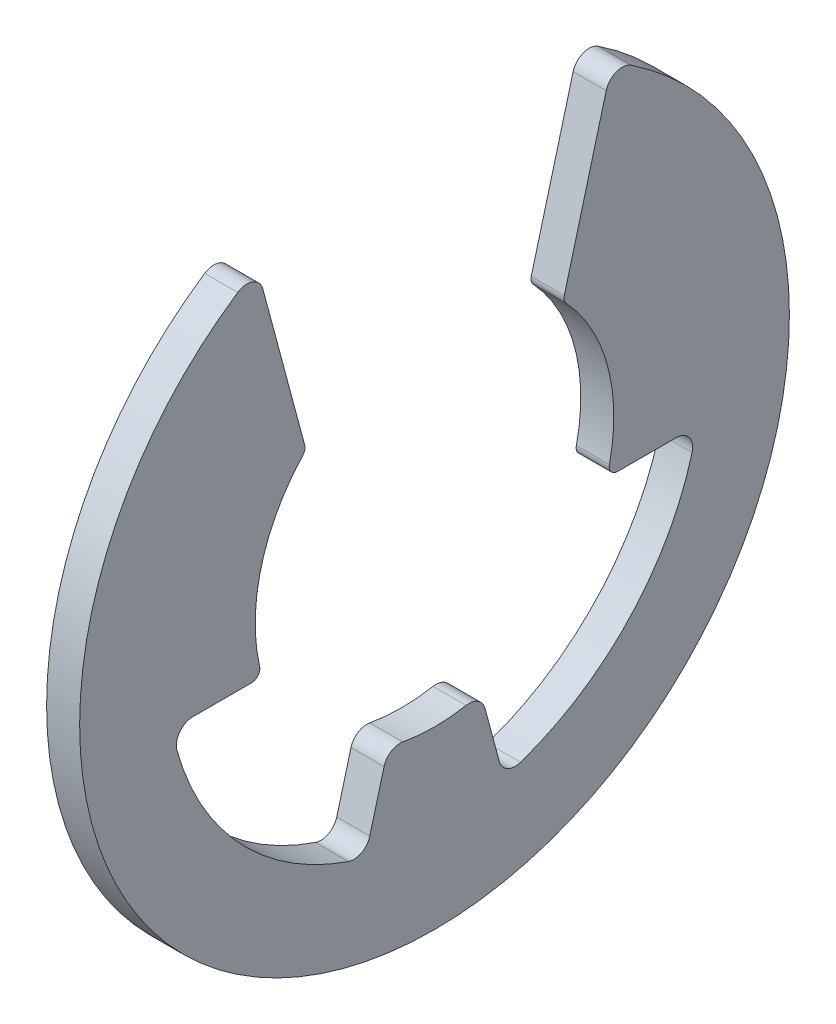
ISO-10303-21;
HEADER;
FILE_DESCRIPTION(('STEP AP214'),'2;1');
FILE_NAME('part.step','',(''),(''),'','','');
FILE_SCHEMA(('AUTOMOTIVE_DESIGN { 1 0 10303 214 1 1 1 1 }'));
ENDSEC;
DATA;
#1=APPLICATION_CONTEXT('core data for automotive mechanical design processes');
#2=APPLICATION_PROTOCOL_DEFINITION('international standard','automotive_design',2000,#1);
#3=PRODUCT_CONTEXT('',#1,'mechanical');
#4=PRODUCT('Part','Part','',(#3));
#5=PRODUCT_RELATED_PRODUCT_CATEGORY('part','',(#4));
#6=PRODUCT_DEFINITION_FORMATION('','',#4);
#7=PRODUCT_DEFINITION_CONTEXT('part definition',#1,'design');
#8=PRODUCT_DEFINITION('design','',#6,#7);
#9=PRODUCT_DEFINITION_SHAPE('','',#8);
#10=(LENGTH_UNIT() NAMED_UNIT(*) SI_UNIT(.MILLI.,.METRE.));
#11=(NAMED_UNIT(*) PLANE_ANGLE_UNIT() SI_UNIT($,.RADIAN.));
#12=(NAMED_UNIT(*) SI_UNIT($,.STERADIAN.) SOLID_ANGLE_UNIT());
#13=UNCERTAINTY_MEASURE_WITH_UNIT(LENGTH_MEASURE(1.E-05),#10,'distance_accuracy_value','');
#14=(GEOMETRIC_REPRESENTATION_CONTEXT(3) GLOBAL_UNCERTAINTY_ASSIGNED_CONTEXT((#13)) GLOBAL_UNIT_ASSIGNED_CONTEXT((#10,
#11,#12)) REPRESENTATION_CONTEXT('',''));
#15=CARTESIAN_POINT('',(0.,0.,0.));
#16=DIRECTION('',(0.,0.,1.));
#17=DIRECTION('',(1.,0.,0.));
#18=AXIS2_PLACEMENT_3D('',#15,#16,#17);
#19=CARTESIAN_POINT('',(1.75,14.9164022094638,9.94014940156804));
#20=DIRECTION('',(-1.,0.,0.));
#21=DIRECTION('',(0.,0.,1.));
#22=AXIS2_PLACEMENT_3D('',#19,#20,#21);
#23=CYLINDRICAL_SURFACE('',#22,0.875000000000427);
#24=CARTESIAN_POINT('',(0.,14.9164022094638,9.94014940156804));
#25=DIRECTION('',(1.,0.,0.));
#26=DIRECTION('',(0.,0.,-1.));
#27=AXIS2_PLACEMENT_3D('',#24,#25,#26);
#28=CIRCLE('',#27,0.875000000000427);
#29=CARTESIAN_POINT('',(0.,15.142868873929,9.0949643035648));
#30=VERTEX_POINT('',#29);
#31=CARTESIAN_POINT('',(0.,15.644538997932,10.425372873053));
#32=VERTEX_POINT('',#31);
#33=EDGE_CURVE('E223',#30,#32,#28,.T.);
#34=ORIENTED_EDGE('',*,*,#33,.T.);
#35=DIRECTION('',(-1.,0.,0.));
#36=VECTOR('',#35,1.);
#37=CARTESIAN_POINT('',(1.75,15.644538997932,10.425372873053));
#38=LINE('',#37,#36);
#39=CARTESIAN_POINT('',(1.75,15.644538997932,10.425372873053));
#40=VERTEX_POINT('',#39);
#41=EDGE_CURVE('E11',#40,#32,#38,.T.);
#42=ORIENTED_EDGE('',*,*,#41,.F.);
#43=CARTESIAN_POINT('',(1.75,14.9164022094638,9.94014940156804));
#44=DIRECTION('',(1.,0.,0.));
#45=DIRECTION('',(0.,0.,-1.));
#46=AXIS2_PLACEMENT_3D('',#43,#44,#45);
#47=CIRCLE('',#46,0.875000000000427);
#48=CARTESIAN_POINT('',(1.75,15.142868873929,9.0949643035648));
#49=VERTEX_POINT('',#48);
#50=EDGE_CURVE('E269',#49,#40,#47,.T.);
#51=ORIENTED_EDGE('',*,*,#50,.F.);
#52=DIRECTION('',(-1.,0.,0.));
#53=VECTOR('',#52,1.);
#54=CARTESIAN_POINT('',(1.75,15.142868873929,9.0949643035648));
#55=LINE('',#54,#53);
#56=EDGE_CURVE('E219',#49,#30,#55,.T.);
#57=ORIENTED_EDGE('',*,*,#56,.T.);
#58=EDGE_LOOP('',(#34,#42,#51,#57));
#59=FACE_BOUND('',#58,.T.);
#60=ADVANCED_FACE('F31',(#59),#23,.T.);
#61=CARTESIAN_POINT('',(1.75,0.,0.));
#62=DIRECTION('',(-1.,0.,0.));
#63=DIRECTION('',(0.,0.,1.));
#64=AXIS2_PLACEMENT_3D('',#61,#62,#63);
#65=CYLINDRICAL_SURFACE('',#64,18.8000000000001);
#66=CARTESIAN_POINT('',(0.,0.,0.));
#67=DIRECTION('',(1.,0.,0.));
#68=DIRECTION('',(0.,0.,-1.));
#69=AXIS2_PLACEMENT_3D('',#66,#67,#68);
#70=CIRCLE('',#69,18.8000000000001);
#71=CARTESIAN_POINT('',(0.,15.644538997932,-10.425372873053));
#72=VERTEX_POINT('',#71);
#73=EDGE_CURVE('E226',#32,#72,#70,.T.);
#74=ORIENTED_EDGE('',*,*,#73,.T.);
#75=DIRECTION('',(-1.,0.,0.));
#76=VECTOR('',#75,1.);
#77=CARTESIAN_POINT('',(1.75,15.644538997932,-10.425372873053));
#78=LINE('',#77,#76);
#79=CARTESIAN_POINT('',(1.75,15.644538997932,-10.425372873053));
#80=VERTEX_POINT('',#79);
#81=EDGE_CURVE('E39',#80,#72,#78,.T.);
#82=ORIENTED_EDGE('',*,*,#81,.F.);
#83=CARTESIAN_POINT('',(1.75,0.,0.));
#84=DIRECTION('',(1.,0.,0.));
#85=DIRECTION('',(0.,0.,-1.));
#86=AXIS2_PLACEMENT_3D('',#83,#84,#85);
#87=CIRCLE('',#86,18.8000000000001);
#88=EDGE_CURVE('E138',#40,#80,#87,.T.);
#89=ORIENTED_EDGE('',*,*,#88,.F.);
#90=ORIENTED_EDGE('',*,*,#41,.T.);
#91=EDGE_LOOP('',(#74,#82,#89,#90));
#92=FACE_BOUND('',#91,.T.);
#93=ADVANCED_FACE('F407',(#92),#65,.T.);
#94=CARTESIAN_POINT('',(1.75,14.9164022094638,-9.94014940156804));
#95=DIRECTION('',(-1.,0.,0.));
#96=DIRECTION('',(0.,0.,1.));
#97=AXIS2_PLACEMENT_3D('',#94,#95,#96);
#98=CYLINDRICAL_SURFACE('',#97,0.875000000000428);
#99=CARTESIAN_POINT('',(0.,14.9164022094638,-9.94014940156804));
#100=DIRECTION('',(1.,0.,0.));
#101=DIRECTION('',(0.,0.,-1.));
#102=AXIS2_PLACEMENT_3D('',#99,#100,#101);
#103=CIRCLE('',#102,0.875000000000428);
#104=CARTESIAN_POINT('',(0.,15.142868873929,-9.0949643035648));
#105=VERTEX_POINT('',#104);
#106=EDGE_CURVE('E228',#72,#105,#103,.T.);
#107=ORIENTED_EDGE('',*,*,#106,.T.);
#108=DIRECTION('',(-1.,0.,0.));
#109=VECTOR('',#108,1.);
#110=CARTESIAN_POINT('',(1.75,15.142868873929,-9.0949643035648));
#111=LINE('',#110,#109);
#112=CARTESIAN_POINT('',(1.75,15.142868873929,-9.0949643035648));
#113=VERTEX_POINT('',#112);
#114=EDGE_CURVE('E324',#113,#105,#111,.T.);
#115=ORIENTED_EDGE('',*,*,#114,.F.);
#116=CARTESIAN_POINT('',(1.75,14.9164022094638,-9.94014940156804));
#117=DIRECTION('',(1.,0.,0.));
#118=DIRECTION('',(0.,0.,-1.));
#119=AXIS2_PLACEMENT_3D('',#116,#117,#118);
#120=CIRCLE('',#119,0.875000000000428);
#121=EDGE_CURVE('E332',#80,#113,#120,.T.);
#122=ORIENTED_EDGE('',*,*,#121,.F.);
#123=ORIENTED_EDGE('',*,*,#81,.T.);
#124=EDGE_LOOP('',(#107,#115,#122,#123));
#125=FACE_BOUND('',#124,.T.);
#126=ADVANCED_FACE('F330',(#125),#98,.T.);
#127=CARTESIAN_POINT('',(1.75,15.142868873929,-9.0949643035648));
#128=DIRECTION('',(0.,-0.258819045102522,-0.965925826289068));
#129=DIRECTION('',(0.,0.965925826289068,-0.258819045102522));
#130=AXIS2_PLACEMENT_3D('',#127,#128,#129);
#131=PLANE('',#130);
#132=DIRECTION('',(0.,-0.965925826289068,0.258819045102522));
#133=VECTOR('',#132,1.);
#134=CARTESIAN_POINT('',(0.,15.142868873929,-9.0949643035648));
#135=LINE('',#134,#133);
#136=CARTESIAN_POINT('',(0.,6.8583782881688,-6.8751417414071));
#137=VERTEX_POINT('',#136);
#138=EDGE_CURVE('E230',#105,#137,#135,.T.);
#139=ORIENTED_EDGE('',*,*,#138,.T.);
#140=DIRECTION('',(-1.,0.,0.));
#141=VECTOR('',#140,1.);
#142=CARTESIAN_POINT('',(1.75,6.8583782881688,-6.8751417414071));
#143=LINE('',#142,#141);
#144=CARTESIAN_POINT('',(1.75,6.8583782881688,-6.8751417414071));
#145=VERTEX_POINT('',#144);
#146=EDGE_CURVE('E321',#145,#137,#143,.T.);
#147=ORIENTED_EDGE('',*,*,#146,.F.);
#148=DIRECTION('',(0.,-0.965925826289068,0.258819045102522));
#149=VECTOR('',#148,1.);
#150=CARTESIAN_POINT('',(1.75,15.142868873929,-9.0949643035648));
#151=LINE('',#150,#149);
#152=EDGE_CURVE('E350',#113,#145,#151,.T.);
#153=ORIENTED_EDGE('',*,*,#152,.F.);
#154=ORIENTED_EDGE('',*,*,#114,.T.);
#155=EDGE_LOOP('',(#139,#147,#153,#154));
#156=FACE_BOUND('',#155,.T.);
#157=ADVANCED_FACE('F341',(#156),#131,.F.);
#158=CARTESIAN_POINT('',(1.75,6.74514495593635,-7.29773429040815));
#159=DIRECTION('',(-1.,0.,0.));
#160=DIRECTION('',(0.,0.,1.));
#161=AXIS2_PLACEMENT_3D('',#158,#159,#160);
#162=CYLINDRICAL_SURFACE('',#161,0.43749999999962);
#163=CARTESIAN_POINT('',(0.,6.74514495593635,-7.29773429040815));
#164=DIRECTION('',(1.,0.,0.));
#165=DIRECTION('',(0.,0.,-1.));
#166=AXIS2_PLACEMENT_3D('',#163,#164,#165);
#167=CIRCLE('',#166,0.43749999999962);
#168=CARTESIAN_POINT('',(0.,6.448188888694,-6.9764503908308));
#169=VERTEX_POINT('',#168);
#170=EDGE_CURVE('E232',#137,#169,#167,.T.);
#171=ORIENTED_EDGE('',*,*,#170,.T.);
#172=DIRECTION('',(-1.,0.,0.));
#173=VECTOR('',#172,1.);
#174=CARTESIAN_POINT('',(1.75,6.448188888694,-6.9764503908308));
#175=LINE('',#174,#173);
#176=CARTESIAN_POINT('',(1.75,6.448188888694,-6.9764503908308));
#177=VERTEX_POINT('',#176);
#178=EDGE_CURVE('E318',#177,#169,#175,.T.);
#179=ORIENTED_EDGE('',*,*,#178,.F.);
#180=CARTESIAN_POINT('',(1.75,6.74514495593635,-7.29773429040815));
#181=DIRECTION('',(1.,0.,0.));
#182=DIRECTION('',(0.,0.,-1.));
#183=AXIS2_PLACEMENT_3D('',#180,#181,#182);
#184=CIRCLE('',#183,0.43749999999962);
#185=EDGE_CURVE('E347',#145,#177,#184,.T.);
#186=ORIENTED_EDGE('',*,*,#185,.F.);
#187=ORIENTED_EDGE('',*,*,#146,.T.);
#188=EDGE_LOOP('',(#171,#179,#186,#187));
#189=FACE_BOUND('',#188,.T.);
#190=ADVANCED_FACE('F345',(#189),#162,.T.);
#191=CARTESIAN_POINT('',(1.75,0.,0.));
#192=DIRECTION('',(-1.,0.,0.));
#193=DIRECTION('',(0.,0.,1.));
#194=AXIS2_PLACEMENT_3D('',#191,#192,#193);
#195=CYLINDRICAL_SURFACE('',#194,9.5);
#196=CARTESIAN_POINT('',(0.,0.,0.));
#197=DIRECTION('',(-1.,0.,0.));
#198=DIRECTION('',(0.,0.,1.));
#199=AXIS2_PLACEMENT_3D('',#196,#197,#198);
#200=CIRCLE('',#199,9.5);
#201=CARTESIAN_POINT('',(0.,-2.09788679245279,-9.26546658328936));
#202=VERTEX_POINT('',#201);
#203=EDGE_CURVE('E234',#169,#202,#200,.T.);
#204=ORIENTED_EDGE('',*,*,#203,.T.);
#205=DIRECTION('',(-1.,0.,0.));
#206=VECTOR('',#205,1.);
#207=CARTESIAN_POINT('',(1.75,-2.09788679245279,-9.26546658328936));
#208=LINE('',#207,#206);
#209=CARTESIAN_POINT('',(1.75,-2.09788679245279,-9.26546658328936));
#210=VERTEX_POINT('',#209);
#211=EDGE_CURVE('E315',#210,#202,#208,.T.);
#212=ORIENTED_EDGE('',*,*,#211,.F.);
#213=CARTESIAN_POINT('',(1.75,0.,0.));
#214=DIRECTION('',(-1.,0.,0.));
#215=DIRECTION('',(0.,0.,1.));
#216=AXIS2_PLACEMENT_3D('',#213,#214,#215);
#217=CIRCLE('',#216,9.5);
#218=EDGE_CURVE('E349',#177,#210,#217,.T.);
#219=ORIENTED_EDGE('',*,*,#218,.F.);
#220=ORIENTED_EDGE('',*,*,#178,.T.);
#221=EDGE_LOOP('',(#204,#212,#219,#220));
#222=FACE_BOUND('',#221,.T.);
#223=ADVANCED_FACE('F420',(#222),#195,.F.);
#224=CARTESIAN_POINT('',(1.75,-2.19450000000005,-9.6921657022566));
#225=DIRECTION('',(-1.,0.,0.));
#226=DIRECTION('',(0.,0.,1.));
#227=AXIS2_PLACEMENT_3D('',#224,#225,#226);
#228=CYLINDRICAL_SURFACE('',#227,0.437499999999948);
#229=CARTESIAN_POINT('',(0.,-2.19450000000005,-9.6921657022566));
#230=DIRECTION('',(1.,0.,0.));
#231=DIRECTION('',(0.,0.,-1.));
#232=AXIS2_PLACEMENT_3D('',#229,#230,#231);
#233=CIRCLE('',#232,0.437499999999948);
#234=CARTESIAN_POINT('',(0.,-2.632,-9.6921657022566));
#235=VERTEX_POINT('',#234);
#236=EDGE_CURVE('E236',#202,#235,#233,.T.);
#237=ORIENTED_EDGE('',*,*,#236,.T.);
#238=DIRECTION('',(-1.,0.,0.));
#239=VECTOR('',#238,1.);
#240=CARTESIAN_POINT('',(1.75,-2.632,-9.6921657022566));
#241=LINE('',#240,#239);
#242=CARTESIAN_POINT('',(1.75,-2.632,-9.6921657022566));
#243=VERTEX_POINT('',#242);
#244=EDGE_CURVE('E312',#243,#235,#241,.T.);
#245=ORIENTED_EDGE('',*,*,#244,.F.);
#246=CARTESIAN_POINT('',(1.75,-2.19450000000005,-9.6921657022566));
#247=DIRECTION('',(1.,0.,0.));
#248=DIRECTION('',(0.,0.,-1.));
#249=AXIS2_PLACEMENT_3D('',#246,#247,#248);
#250=CIRCLE('',#249,0.437499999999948);
#251=EDGE_CURVE('E352',#210,#243,#250,.T.);
#252=ORIENTED_EDGE('',*,*,#251,.F.);
#253=ORIENTED_EDGE('',*,*,#211,.T.);
#254=EDGE_LOOP('',(#237,#245,#252,#253));
#255=FACE_BOUND('',#254,.T.);
#256=ADVANCED_FACE('F423',(#255),#228,.T.);
#257=CARTESIAN_POINT('',(1.75,-2.632,-9.6921657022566));
#258=DIRECTION('',(0.,1.,0.));
#259=DIRECTION('',(0.,0.,1.));
#260=AXIS2_PLACEMENT_3D('',#257,#258,#259);
#261=PLANE('',#260);
#262=DIRECTION('',(0.,0.,-1.));
#263=VECTOR('',#262,1.);
#264=CARTESIAN_POINT('',(0.,-2.632,-9.6921657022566));
#265=LINE('',#264,#263);
#266=CARTESIAN_POINT('',(0.,-2.632,-12.803381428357));
#267=VERTEX_POINT('',#266);
#268=EDGE_CURVE('E238',#235,#267,#265,.T.);
#269=ORIENTED_EDGE('',*,*,#268,.T.);
#270=DIRECTION('',(-1.,0.,0.));
#271=VECTOR('',#270,1.);
#272=CARTESIAN_POINT('',(1.75,-2.632,-12.803381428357));
#273=LINE('',#272,#271);
#274=CARTESIAN_POINT('',(1.75,-2.632,-12.803381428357));
#275=VERTEX_POINT('',#274);
#276=EDGE_CURVE('E309',#275,#267,#273,.T.);
#277=ORIENTED_EDGE('',*,*,#276,.F.);
#278=DIRECTION('',(0.,0.,-1.));
#279=VECTOR('',#278,1.);
#280=CARTESIAN_POINT('',(1.75,-2.632,-9.6921657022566));
#281=LINE('',#280,#279);
#282=EDGE_CURVE('E358',#243,#275,#281,.T.);
#283=ORIENTED_EDGE('',*,*,#282,.F.);
#284=ORIENTED_EDGE('',*,*,#244,.T.);
#285=EDGE_LOOP('',(#269,#277,#283,#284));
#286=FACE_BOUND('',#285,.T.);
#287=ADVANCED_FACE('F427',(#286),#261,.F.);
#288=CARTESIAN_POINT('',(1.75,-3.50699999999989,-12.8033814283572));
#289=DIRECTION('',(-1.,0.,0.));
#290=DIRECTION('',(0.,0.,1.));
#291=AXIS2_PLACEMENT_3D('',#288,#289,#290);
#292=CYLINDRICAL_SURFACE('',#291,0.874999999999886);
#293=CARTESIAN_POINT('',(0.,-3.50699999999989,-12.8033814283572));
#294=DIRECTION('',(-1.,0.,0.));
#295=DIRECTION('',(0.,0.,1.));
#296=AXIS2_PLACEMENT_3D('',#293,#294,#295);
#297=CIRCLE('',#296,0.874999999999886);
#298=CARTESIAN_POINT('',(0.,-3.7381582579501,-13.647295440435));
#299=VERTEX_POINT('',#298);
#300=EDGE_CURVE('E240',#267,#299,#297,.T.);
#301=ORIENTED_EDGE('',*,*,#300,.T.);
#302=DIRECTION('',(-1.,0.,0.));
#303=VECTOR('',#302,1.);
#304=CARTESIAN_POINT('',(1.75,-3.7381582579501,-13.647295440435));
#305=LINE('',#304,#303);
#306=CARTESIAN_POINT('',(1.75,-3.7381582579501,-13.647295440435));
#307=VERTEX_POINT('',#306);
#308=EDGE_CURVE('E306',#307,#299,#305,.T.);
#309=ORIENTED_EDGE('',*,*,#308,.F.);
#310=CARTESIAN_POINT('',(1.75,-3.50699999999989,-12.8033814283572));
#311=DIRECTION('',(-1.,0.,0.));
#312=DIRECTION('',(0.,0.,1.));
#313=AXIS2_PLACEMENT_3D('',#310,#311,#312);
#314=CIRCLE('',#313,0.874999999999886);
#315=EDGE_CURVE('E360',#275,#307,#314,.T.);
#316=ORIENTED_EDGE('',*,*,#315,.F.);
#317=ORIENTED_EDGE('',*,*,#276,.T.);
#318=EDGE_LOOP('',(#301,#309,#316,#317));
#319=FACE_BOUND('',#318,.T.);
#320=ADVANCED_FACE('F431',(#319),#292,.F.);
#321=CARTESIAN_POINT('',(1.75,0.,0.));
#322=DIRECTION('',(-1.,0.,0.));
#323=DIRECTION('',(0.,0.,1.));
#324=AXIS2_PLACEMENT_3D('',#321,#322,#323);
#325=CYLINDRICAL_SURFACE('',#324,14.1499999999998);
#326=CARTESIAN_POINT('',(0.,0.,0.));
#327=DIRECTION('',(-1.,0.,0.));
#328=DIRECTION('',(0.,0.,1.));
#329=AXIS2_PLACEMENT_3D('',#326,#327,#328);
#330=CIRCLE('',#329,14.1499999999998);
#331=CARTESIAN_POINT('',(0.,-13.3967337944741,-4.55521938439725));
#332=VERTEX_POINT('',#331);
#333=EDGE_CURVE('E242',#299,#332,#330,.T.);
#334=ORIENTED_EDGE('',*,*,#333,.T.);
#335=DIRECTION('',(-1.,0.,0.));
#336=VECTOR('',#335,1.);
#337=CARTESIAN_POINT('',(1.75,-13.3967337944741,-4.55521938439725));
#338=LINE('',#337,#336);
#339=CARTESIAN_POINT('',(1.75,-13.3967337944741,-4.55521938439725));
#340=VERTEX_POINT('',#339);
#341=EDGE_CURVE('E303',#340,#332,#338,.T.);
#342=ORIENTED_EDGE('',*,*,#341,.F.);
#343=CARTESIAN_POINT('',(1.75,0.,0.));
#344=DIRECTION('',(-1.,0.,0.));
#345=DIRECTION('',(0.,0.,1.));
#346=AXIS2_PLACEMENT_3D('',#343,#344,#345);
#347=CIRCLE('',#346,14.1499999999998);
#348=EDGE_CURVE('E362',#307,#340,#347,.T.);
#349=ORIENTED_EDGE('',*,*,#348,.F.);
#350=ORIENTED_EDGE('',*,*,#308,.T.);
#351=EDGE_LOOP('',(#334,#342,#349,#350));
#352=FACE_BOUND('',#351,.T.);
#353=ADVANCED_FACE('F435',(#352),#325,.F.);
#354=CARTESIAN_POINT('',(1.75,-12.5683138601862,-4.27353620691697));
#355=DIRECTION('',(-1.,0.,0.));
#356=DIRECTION('',(0.,0.,1.));
#357=AXIS2_PLACEMENT_3D('',#354,#355,#356);
#358=CYLINDRICAL_SURFACE('',#357,0.875000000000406);
#359=CARTESIAN_POINT('',(0.,-12.5683138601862,-4.27353620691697));
#360=DIRECTION('',(-1.,0.,0.));
#361=DIRECTION('',(0.,0.,1.));
#362=AXIS2_PLACEMENT_3D('',#359,#360,#361);
#363=CIRCLE('',#362,0.875000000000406);
#364=CARTESIAN_POINT('',(0.,-12.794780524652,-3.4283511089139));
#365=VERTEX_POINT('',#364);
#366=EDGE_CURVE('E244',#332,#365,#363,.T.);
#367=ORIENTED_EDGE('',*,*,#366,.T.);
#368=DIRECTION('',(-1.,0.,0.));
#369=VECTOR('',#368,1.);
#370=CARTESIAN_POINT('',(1.75,-12.794780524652,-3.4283511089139));
#371=LINE('',#370,#369);
#372=CARTESIAN_POINT('',(1.75,-12.794780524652,-3.4283511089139));
#373=VERTEX_POINT('',#372);
#374=EDGE_CURVE('E300',#373,#365,#371,.T.);
#375=ORIENTED_EDGE('',*,*,#374,.F.);
#376=CARTESIAN_POINT('',(1.75,-12.5683138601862,-4.27353620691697));
#377=DIRECTION('',(-1.,0.,0.));
#378=DIRECTION('',(0.,0.,1.));
#379=AXIS2_PLACEMENT_3D('',#376,#377,#378);
#380=CIRCLE('',#379,0.875000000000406);
#381=EDGE_CURVE('E364',#340,#373,#380,.T.);
#382=ORIENTED_EDGE('',*,*,#381,.F.);
#383=ORIENTED_EDGE('',*,*,#341,.T.);
#384=EDGE_LOOP('',(#367,#375,#382,#383));
#385=FACE_BOUND('',#384,.T.);
#386=ADVANCED_FACE('F439',(#385),#358,.F.);
#387=CARTESIAN_POINT('',(1.75,-12.794780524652,-3.4283511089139));
#388=DIRECTION('',(0.,-0.258819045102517,0.965925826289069));
#389=DIRECTION('',(0.,-0.965925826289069,-0.258819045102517));
#390=AXIS2_PLACEMENT_3D('',#387,#388,#389);
#391=PLANE('',#390);
#392=DIRECTION('',(0.,0.965925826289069,0.258819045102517));
#393=VECTOR('',#392,1.);
#394=CARTESIAN_POINT('',(0.,-12.794780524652,-3.4283511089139));
#395=LINE('',#394,#393);
#396=CARTESIAN_POINT('',(0.,-9.9857765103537,-2.6756807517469));
#397=VERTEX_POINT('',#396);
#398=EDGE_CURVE('E246',#365,#397,#395,.T.);
#399=ORIENTED_EDGE('',*,*,#398,.T.);
#400=DIRECTION('',(-1.,0.,0.));
#401=VECTOR('',#400,1.);
#402=CARTESIAN_POINT('',(1.75,-9.9857765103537,-2.6756807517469));
#403=LINE('',#402,#401);
#404=CARTESIAN_POINT('',(1.75,-9.9857765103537,-2.6756807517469));
#405=VERTEX_POINT('',#404);
#406=EDGE_CURVE('E297',#405,#397,#403,.T.);
#407=ORIENTED_EDGE('',*,*,#406,.F.);
#408=DIRECTION('',(0.,0.965925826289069,0.258819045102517));
#409=VECTOR('',#408,1.);
#410=CARTESIAN_POINT('',(1.75,-12.794780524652,-3.4283511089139));
#411=LINE('',#410,#409);
#412=EDGE_CURVE('E366',#373,#405,#411,.T.);
#413=ORIENTED_EDGE('',*,*,#412,.F.);
#414=ORIENTED_EDGE('',*,*,#374,.T.);
#415=EDGE_LOOP('',(#399,#407,#413,#414));
#416=FACE_BOUND('',#415,.T.);
#417=ADVANCED_FACE('F443',(#416),#391,.F.);
#418=CARTESIAN_POINT('',(1.75,-10.2122431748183,-1.83049565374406));
#419=DIRECTION('',(-1.,0.,0.));
#420=DIRECTION('',(0.,0.,1.));
#421=AXIS2_PLACEMENT_3D('',#418,#419,#420);
#422=CYLINDRICAL_SURFACE('',#421,0.874999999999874);
#423=CARTESIAN_POINT('',(0.,-10.2122431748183,-1.83049565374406));
#424=DIRECTION('',(1.,0.,0.));
#425=DIRECTION('',(0.,0.,-1.));
#426=AXIS2_PLACEMENT_3D('',#423,#424,#425);
#427=CIRCLE('',#426,0.874999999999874);
#428=CARTESIAN_POINT('',(0.,-9.3509696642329,-1.6761164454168));
#429=VERTEX_POINT('',#428);
#430=EDGE_CURVE('E248',#397,#429,#427,.T.);
#431=ORIENTED_EDGE('',*,*,#430,.T.);
#432=DIRECTION('',(-1.,0.,0.));
#433=VECTOR('',#432,1.);
#434=CARTESIAN_POINT('',(1.75,-9.3509696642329,-1.6761164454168));
#435=LINE('',#434,#433);
#436=CARTESIAN_POINT('',(1.75,-9.3509696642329,-1.6761164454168));
#437=VERTEX_POINT('',#436);
#438=EDGE_CURVE('E294',#437,#429,#435,.T.);
#439=ORIENTED_EDGE('',*,*,#438,.F.);
#440=CARTESIAN_POINT('',(1.75,-10.2122431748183,-1.83049565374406));
#441=DIRECTION('',(1.,0.,0.));
#442=DIRECTION('',(0.,0.,-1.));
#443=AXIS2_PLACEMENT_3D('',#440,#441,#442);
#444=CIRCLE('',#443,0.874999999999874);
#445=EDGE_CURVE('E368',#405,#437,#444,.T.);
#446=ORIENTED_EDGE('',*,*,#445,.F.);
#447=ORIENTED_EDGE('',*,*,#406,.T.);
#448=EDGE_LOOP('',(#431,#439,#446,#447));
#449=FACE_BOUND('',#448,.T.);
#450=ADVANCED_FACE('F447',(#449),#422,.T.);
#451=CARTESIAN_POINT('',(1.75,0.,0.));
#452=DIRECTION('',(-1.,0.,0.));
#453=DIRECTION('',(0.,0.,1.));
#454=AXIS2_PLACEMENT_3D('',#451,#452,#453);
#455=CYLINDRICAL_SURFACE('',#454,9.50000000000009);
#456=CARTESIAN_POINT('',(0.,0.,0.));
#457=DIRECTION('',(-1.,0.,0.));
#458=DIRECTION('',(0.,0.,1.));
#459=AXIS2_PLACEMENT_3D('',#456,#457,#458);
#460=CIRCLE('',#459,9.50000000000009);
#461=CARTESIAN_POINT('',(0.,-9.35096968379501,1.6761163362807));
#462=VERTEX_POINT('',#461);
#463=EDGE_CURVE('E250',#429,#462,#460,.T.);
#464=ORIENTED_EDGE('',*,*,#463,.T.);
#465=DIRECTION('',(-1.,0.,0.));
#466=VECTOR('',#465,1.);
#467=CARTESIAN_POINT('',(1.75,-9.35096968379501,1.6761163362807));
#468=LINE('',#467,#466);
#469=CARTESIAN_POINT('',(1.75,-9.35096968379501,1.6761163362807));
#470=VERTEX_POINT('',#469);
#471=EDGE_CURVE('E291',#470,#462,#468,.T.);
#472=ORIENTED_EDGE('',*,*,#471,.F.);
#473=CARTESIAN_POINT('',(1.75,0.,0.));
#474=DIRECTION('',(-1.,0.,0.));
#475=DIRECTION('',(0.,0.,1.));
#476=AXIS2_PLACEMENT_3D('',#473,#474,#475);
#477=CIRCLE('',#476,9.50000000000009);
#478=EDGE_CURVE('E370',#437,#470,#477,.T.);
#479=ORIENTED_EDGE('',*,*,#478,.F.);
#480=ORIENTED_EDGE('',*,*,#438,.T.);
#481=EDGE_LOOP('',(#464,#472,#479,#480));
#482=FACE_BOUND('',#481,.T.);
#483=ADVANCED_FACE('F451',(#482),#455,.F.);
#484=CARTESIAN_POINT('',(1.75,-10.2122431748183,1.830495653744));
#485=DIRECTION('',(-1.,0.,0.));
#486=DIRECTION('',(0.,0.,1.));
#487=AXIS2_PLACEMENT_3D('',#484,#485,#486);
#488=CYLINDRICAL_SURFACE('',#487,0.874999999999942);
#489=CARTESIAN_POINT('',(0.,-10.2122431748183,1.830495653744));
#490=DIRECTION('',(1.,0.,0.));
#491=DIRECTION('',(0.,0.,-1.));
#492=AXIS2_PLACEMENT_3D('',#489,#490,#491);
#493=CIRCLE('',#492,0.874999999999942);
#494=CARTESIAN_POINT('',(0.,-9.9857765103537,2.6756807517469));
#495=VERTEX_POINT('',#494);
#496=EDGE_CURVE('E252',#462,#495,#493,.T.);
#497=ORIENTED_EDGE('',*,*,#496,.T.);
#498=DIRECTION('',(-1.,0.,0.));
#499=VECTOR('',#498,1.);
#500=CARTESIAN_POINT('',(1.75,-9.9857765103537,2.6756807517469));
#501=LINE('',#500,#499);
#502=CARTESIAN_POINT('',(1.75,-9.9857765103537,2.6756807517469));
#503=VERTEX_POINT('',#502);
#504=EDGE_CURVE('E288',#503,#495,#501,.T.);
#505=ORIENTED_EDGE('',*,*,#504,.F.);
#506=CARTESIAN_POINT('',(1.75,-10.2122431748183,1.830495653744));
#507=DIRECTION('',(1.,0.,0.));
#508=DIRECTION('',(0.,0.,-1.));
#509=AXIS2_PLACEMENT_3D('',#506,#507,#508);
#510=CIRCLE('',#509,0.874999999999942);
#511=EDGE_CURVE('E372',#470,#503,#510,.T.);
#512=ORIENTED_EDGE('',*,*,#511,.F.);
#513=ORIENTED_EDGE('',*,*,#471,.T.);
#514=EDGE_LOOP('',(#497,#505,#512,#513));
#515=FACE_BOUND('',#514,.T.);
#516=ADVANCED_FACE('F455',(#515),#488,.T.);
#517=CARTESIAN_POINT('',(1.75,-9.9857765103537,2.6756807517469));
#518=DIRECTION('',(0.,-0.258819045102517,-0.965925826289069));
#519=DIRECTION('',(0.,0.965925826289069,-0.258819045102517));
#520=AXIS2_PLACEMENT_3D('',#517,#518,#519);
#521=PLANE('',#520);
#522=DIRECTION('',(0.,-0.965925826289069,0.258819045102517));
#523=VECTOR('',#522,1.);
#524=CARTESIAN_POINT('',(0.,-9.9857765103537,2.6756807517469));
#525=LINE('',#524,#523);
#526=CARTESIAN_POINT('',(0.,-12.794780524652,3.4283511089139));
#527=VERTEX_POINT('',#526);
#528=EDGE_CURVE('E254',#495,#527,#525,.T.);
#529=ORIENTED_EDGE('',*,*,#528,.T.);
#530=DIRECTION('',(-1.,0.,0.));
#531=VECTOR('',#530,1.);
#532=CARTESIAN_POINT('',(1.75,-12.794780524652,3.4283511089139));
#533=LINE('',#532,#531);
#534=CARTESIAN_POINT('',(1.75,-12.794780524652,3.4283511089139));
#535=VERTEX_POINT('',#534);
#536=EDGE_CURVE('E285',#535,#527,#533,.T.);
#537=ORIENTED_EDGE('',*,*,#536,.F.);
#538=DIRECTION('',(0.,-0.965925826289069,0.258819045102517));
#539=VECTOR('',#538,1.);
#540=CARTESIAN_POINT('',(1.75,-9.9857765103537,2.6756807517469));
#541=LINE('',#540,#539);
#542=EDGE_CURVE('E374',#503,#535,#541,.T.);
#543=ORIENTED_EDGE('',*,*,#542,.F.);
#544=ORIENTED_EDGE('',*,*,#504,.T.);
#545=EDGE_LOOP('',(#529,#537,#543,#544));
#546=FACE_BOUND('',#545,.T.);
#547=ADVANCED_FACE('F459',(#546),#521,.F.);
#548=CARTESIAN_POINT('',(1.75,-12.568313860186,4.27353620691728));
#549=DIRECTION('',(-1.,0.,0.));
#550=DIRECTION('',(0.,0.,1.));
#551=AXIS2_PLACEMENT_3D('',#548,#549,#550);
#552=CYLINDRICAL_SURFACE('',#551,0.875000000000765);
#553=CARTESIAN_POINT('',(0.,-12.568313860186,4.27353620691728));
#554=DIRECTION('',(-1.,0.,0.));
#555=DIRECTION('',(0.,0.,1.));
#556=AXIS2_PLACEMENT_3D('',#553,#554,#555);
#557=CIRCLE('',#556,0.875000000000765);
#558=CARTESIAN_POINT('',(0.,-13.396733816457,4.5552193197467));
#559=VERTEX_POINT('',#558);
#560=EDGE_CURVE('E256',#527,#559,#557,.T.);
#561=ORIENTED_EDGE('',*,*,#560,.T.);
#562=DIRECTION('',(-1.,0.,0.));
#563=VECTOR('',#562,1.);
#564=CARTESIAN_POINT('',(1.75,-13.396733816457,4.5552193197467));
#565=LINE('',#564,#563);
#566=CARTESIAN_POINT('',(1.75,-13.396733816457,4.5552193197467));
#567=VERTEX_POINT('',#566);
#568=EDGE_CURVE('E282',#567,#559,#565,.T.);
#569=ORIENTED_EDGE('',*,*,#568,.F.);
#570=CARTESIAN_POINT('',(1.75,-12.568313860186,4.27353620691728));
#571=DIRECTION('',(-1.,0.,0.));
#572=DIRECTION('',(0.,0.,1.));
#573=AXIS2_PLACEMENT_3D('',#570,#571,#572);
#574=CIRCLE('',#573,0.875000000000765);
#575=EDGE_CURVE('E376',#535,#567,#574,.T.);
#576=ORIENTED_EDGE('',*,*,#575,.F.);
#577=ORIENTED_EDGE('',*,*,#536,.T.);
#578=EDGE_LOOP('',(#561,#569,#576,#577));
#579=FACE_BOUND('',#578,.T.);
#580=ADVANCED_FACE('F463',(#579),#552,.F.);
#581=CARTESIAN_POINT('',(1.75,0.,0.));
#582=DIRECTION('',(-1.,0.,0.));
#583=DIRECTION('',(0.,0.,1.));
#584=AXIS2_PLACEMENT_3D('',#581,#582,#583);
#585=CYLINDRICAL_SURFACE('',#584,14.1500000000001);
#586=CARTESIAN_POINT('',(0.,0.,0.));
#587=DIRECTION('',(-1.,0.,0.));
#588=DIRECTION('',(0.,0.,1.));
#589=AXIS2_PLACEMENT_3D('',#586,#587,#588);
#590=CIRCLE('',#589,14.1500000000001);
#591=CARTESIAN_POINT('',(0.,-3.73815819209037,13.6472954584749));
#592=VERTEX_POINT('',#591);
#593=EDGE_CURVE('E258',#559,#592,#590,.T.);
#594=ORIENTED_EDGE('',*,*,#593,.T.);
#595=DIRECTION('',(-1.,0.,0.));
#596=VECTOR('',#595,1.);
#597=CARTESIAN_POINT('',(1.75,-3.73815819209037,13.6472954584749));
#598=LINE('',#597,#596);
#599=CARTESIAN_POINT('',(1.75,-3.73815819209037,13.6472954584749));
#600=VERTEX_POINT('',#599);
#601=EDGE_CURVE('E279',#600,#592,#598,.T.);
#602=ORIENTED_EDGE('',*,*,#601,.F.);
#603=CARTESIAN_POINT('',(1.75,0.,0.));
#604=DIRECTION('',(-1.,0.,0.));
#605=DIRECTION('',(0.,0.,1.));
#606=AXIS2_PLACEMENT_3D('',#603,#604,#605);
#607=CIRCLE('',#606,14.1500000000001);
#608=EDGE_CURVE('E378',#567,#600,#607,.T.);
#609=ORIENTED_EDGE('',*,*,#608,.F.);
#610=ORIENTED_EDGE('',*,*,#568,.T.);
#611=EDGE_LOOP('',(#594,#602,#609,#610));
#612=FACE_BOUND('',#611,.T.);
#613=ADVANCED_FACE('F467',(#612),#585,.F.);
#614=CARTESIAN_POINT('',(1.75,-3.50700000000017,12.8033814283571));
#615=DIRECTION('',(-1.,0.,0.));
#616=DIRECTION('',(0.,0.,1.));
#617=AXIS2_PLACEMENT_3D('',#614,#615,#616);
#618=CYLINDRICAL_SURFACE('',#617,0.875000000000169);
#619=CARTESIAN_POINT('',(0.,-3.50700000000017,12.8033814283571));
#620=DIRECTION('',(-1.,0.,0.));
#621=DIRECTION('',(0.,0.,1.));
#622=AXIS2_PLACEMENT_3D('',#619,#620,#621);
#623=CIRCLE('',#622,0.875000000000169);
#624=CARTESIAN_POINT('',(0.,-2.632,12.803381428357));
#625=VERTEX_POINT('',#624);
#626=EDGE_CURVE('E260',#592,#625,#623,.T.);
#627=ORIENTED_EDGE('',*,*,#626,.T.);
#628=DIRECTION('',(-1.,0.,0.));
#629=VECTOR('',#628,1.);
#630=CARTESIAN_POINT('',(1.75,-2.632,12.803381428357));
#631=LINE('',#630,#629);
#632=CARTESIAN_POINT('',(1.75,-2.632,12.803381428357));
#633=VERTEX_POINT('',#632);
#634=EDGE_CURVE('E276',#633,#625,#631,.T.);
#635=ORIENTED_EDGE('',*,*,#634,.F.);
#636=CARTESIAN_POINT('',(1.75,-3.50700000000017,12.8033814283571));
#637=DIRECTION('',(-1.,0.,0.));
#638=DIRECTION('',(0.,0.,1.));
#639=AXIS2_PLACEMENT_3D('',#636,#637,#638);
#640=CIRCLE('',#639,0.875000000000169);
#641=EDGE_CURVE('E380',#600,#633,#640,.T.);
#642=ORIENTED_EDGE('',*,*,#641,.F.);
#643=ORIENTED_EDGE('',*,*,#601,.T.);
#644=EDGE_LOOP('',(#627,#635,#642,#643));
#645=FACE_BOUND('',#644,.T.);
#646=ADVANCED_FACE('F471',(#645),#618,.F.);
#647=CARTESIAN_POINT('',(1.75,-2.632,12.803381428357));
#648=DIRECTION('',(0.,1.,0.));
#649=DIRECTION('',(0.,0.,1.));
#650=AXIS2_PLACEMENT_3D('',#647,#648,#649);
#651=PLANE('',#650);
#652=DIRECTION('',(0.,0.,-1.));
#653=VECTOR('',#652,1.);
#654=CARTESIAN_POINT('',(0.,-2.632,12.803381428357));
#655=LINE('',#654,#653);
#656=CARTESIAN_POINT('',(0.,-2.632,9.6921657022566));
#657=VERTEX_POINT('',#656);
#658=EDGE_CURVE('E262',#625,#657,#655,.T.);
#659=ORIENTED_EDGE('',*,*,#658,.T.);
#660=DIRECTION('',(-1.,0.,0.));
#661=VECTOR('',#660,1.);
#662=CARTESIAN_POINT('',(1.75,-2.632,9.6921657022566));
#663=LINE('',#662,#661);
#664=CARTESIAN_POINT('',(1.75,-2.632,9.6921657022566));
#665=VERTEX_POINT('',#664);
#666=EDGE_CURVE('E273',#665,#657,#663,.T.);
#667=ORIENTED_EDGE('',*,*,#666,.F.);
#668=DIRECTION('',(0.,0.,-1.));
#669=VECTOR('',#668,1.);
#670=CARTESIAN_POINT('',(1.75,-2.632,12.803381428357));
#671=LINE('',#670,#669);
#672=EDGE_CURVE('E382',#633,#665,#671,.T.);
#673=ORIENTED_EDGE('',*,*,#672,.F.);
#674=ORIENTED_EDGE('',*,*,#634,.T.);
#675=EDGE_LOOP('',(#659,#667,#673,#674));
#676=FACE_BOUND('',#675,.T.);
#677=ADVANCED_FACE('F388',(#676),#651,.F.);
#678=CARTESIAN_POINT('',(1.75,-2.19450000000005,9.6921657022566));
#679=DIRECTION('',(-1.,0.,0.));
#680=DIRECTION('',(0.,0.,1.));
#681=AXIS2_PLACEMENT_3D('',#678,#679,#680);
#682=CYLINDRICAL_SURFACE('',#681,0.437499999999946);
#683=CARTESIAN_POINT('',(0.,-2.19450000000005,9.6921657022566));
#684=DIRECTION('',(1.,0.,0.));
#685=DIRECTION('',(0.,0.,-1.));
#686=AXIS2_PLACEMENT_3D('',#683,#684,#685);
#687=CIRCLE('',#686,0.437499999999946);
#688=CARTESIAN_POINT('',(0.,-2.0978867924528,9.2654665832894));
#689=VERTEX_POINT('',#688);
#690=EDGE_CURVE('E264',#657,#689,#687,.T.);
#691=ORIENTED_EDGE('',*,*,#690,.T.);
#692=DIRECTION('',(-1.,0.,0.));
#693=VECTOR('',#692,1.);
#694=CARTESIAN_POINT('',(1.75,-2.0978867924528,9.2654665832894));
#695=LINE('',#694,#693);
#696=CARTESIAN_POINT('',(1.75,-2.0978867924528,9.2654665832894));
#697=VERTEX_POINT('',#696);
#698=EDGE_CURVE('E214',#697,#689,#695,.T.);
#699=ORIENTED_EDGE('',*,*,#698,.F.);
#700=CARTESIAN_POINT('',(1.75,-2.19450000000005,9.6921657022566));
#701=DIRECTION('',(1.,0.,0.));
#702=DIRECTION('',(0.,0.,-1.));
#703=AXIS2_PLACEMENT_3D('',#700,#701,#702);
#704=CIRCLE('',#703,0.437499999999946);
#705=EDGE_CURVE('E205',#665,#697,#704,.T.);
#706=ORIENTED_EDGE('',*,*,#705,.F.);
#707=ORIENTED_EDGE('',*,*,#666,.T.);
#708=EDGE_LOOP('',(#691,#699,#706,#707));
#709=FACE_BOUND('',#708,.T.);
#710=ADVANCED_FACE('F392',(#709),#682,.T.);
#711=CARTESIAN_POINT('',(1.75,0.,0.));
#712=DIRECTION('',(-1.,0.,0.));
#713=DIRECTION('',(0.,0.,1.));
#714=AXIS2_PLACEMENT_3D('',#711,#712,#713);
#715=CYLINDRICAL_SURFACE('',#714,9.5);
#716=CARTESIAN_POINT('',(0.,0.,0.));
#717=DIRECTION('',(-1.,0.,0.));
#718=DIRECTION('',(0.,0.,1.));
#719=AXIS2_PLACEMENT_3D('',#716,#717,#718);
#720=CIRCLE('',#719,9.5);
#721=CARTESIAN_POINT('',(0.,6.44818888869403,6.97645039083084));
#722=VERTEX_POINT('',#721);
#723=EDGE_CURVE('E213',#689,#722,#720,.T.);
#724=ORIENTED_EDGE('',*,*,#723,.T.);
#725=DIRECTION('',(-1.,0.,0.));
#726=VECTOR('',#725,1.);
#727=CARTESIAN_POINT('',(1.75,6.44818888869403,6.97645039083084));
#728=LINE('',#727,#726);
#729=CARTESIAN_POINT('',(1.75,6.44818888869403,6.97645039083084));
#730=VERTEX_POINT('',#729);
#731=EDGE_CURVE('E210',#730,#722,#728,.T.);
#732=ORIENTED_EDGE('',*,*,#731,.F.);
#733=CARTESIAN_POINT('',(1.75,0.,0.));
#734=DIRECTION('',(-1.,0.,0.));
#735=DIRECTION('',(0.,0.,1.));
#736=AXIS2_PLACEMENT_3D('',#733,#734,#735);
#737=CIRCLE('',#736,9.5);
#738=EDGE_CURVE('E199',#697,#730,#737,.T.);
#739=ORIENTED_EDGE('',*,*,#738,.F.);
#740=ORIENTED_EDGE('',*,*,#698,.T.);
#741=EDGE_LOOP('',(#724,#732,#739,#740));
#742=FACE_BOUND('',#741,.T.);
#743=ADVANCED_FACE('F211',(#742),#715,.F.);
#744=CARTESIAN_POINT('',(1.75,6.74514495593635,7.29773429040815));
#745=DIRECTION('',(-1.,0.,0.));
#746=DIRECTION('',(0.,0.,1.));
#747=AXIS2_PLACEMENT_3D('',#744,#745,#746);
#748=CYLINDRICAL_SURFACE('',#747,0.43749999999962);
#749=CARTESIAN_POINT('',(0.,6.74514495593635,7.29773429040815));
#750=DIRECTION('',(1.,0.,0.));
#751=DIRECTION('',(0.,0.,-1.));
#752=AXIS2_PLACEMENT_3D('',#749,#750,#751);
#753=CIRCLE('',#752,0.43749999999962);
#754=CARTESIAN_POINT('',(0.,6.8583782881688,6.8751417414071));
#755=VERTEX_POINT('',#754);
#756=EDGE_CURVE('E124',#722,#755,#753,.T.);
#757=ORIENTED_EDGE('',*,*,#756,.T.);
#758=DIRECTION('',(-1.,0.,0.));
#759=VECTOR('',#758,1.);
#760=CARTESIAN_POINT('',(1.75,6.8583782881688,6.8751417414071));
#761=LINE('',#760,#759);
#762=CARTESIAN_POINT('',(1.75,6.8583782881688,6.8751417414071));
#763=VERTEX_POINT('',#762);
#764=EDGE_CURVE('E215',#763,#755,#761,.T.);
#765=ORIENTED_EDGE('',*,*,#764,.F.);
#766=CARTESIAN_POINT('',(1.75,6.74514495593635,7.29773429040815));
#767=DIRECTION('',(1.,0.,0.));
#768=DIRECTION('',(0.,0.,-1.));
#769=AXIS2_PLACEMENT_3D('',#766,#767,#768);
#770=CIRCLE('',#769,0.43749999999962);
#771=EDGE_CURVE('E203',#730,#763,#770,.T.);
#772=ORIENTED_EDGE('',*,*,#771,.F.);
#773=ORIENTED_EDGE('',*,*,#731,.T.);
#774=EDGE_LOOP('',(#757,#765,#772,#773));
#775=FACE_BOUND('',#774,.T.);
#776=ADVANCED_FACE('F217',(#775),#748,.T.);
#777=CARTESIAN_POINT('',(1.75,6.8583782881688,6.8751417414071));
#778=DIRECTION('',(0.,-0.258819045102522,0.965925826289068));
#779=DIRECTION('',(0.,-0.965925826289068,-0.258819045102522));
#780=AXIS2_PLACEMENT_3D('',#777,#778,#779);
#781=PLANE('',#780);
#782=DIRECTION('',(0.,0.965925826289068,0.258819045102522));
#783=VECTOR('',#782,1.);
#784=CARTESIAN_POINT('',(0.,6.8583782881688,6.8751417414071));
#785=LINE('',#784,#783);
#786=EDGE_CURVE('E130',#755,#30,#785,.T.);
#787=ORIENTED_EDGE('',*,*,#786,.T.);
#788=ORIENTED_EDGE('',*,*,#56,.F.);
#789=DIRECTION('',(0.,0.965925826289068,0.258819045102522));
#790=VECTOR('',#789,1.);
#791=CARTESIAN_POINT('',(1.75,6.8583782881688,6.8751417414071));
#792=LINE('',#791,#790);
#793=EDGE_CURVE('E47',#763,#49,#792,.T.);
#794=ORIENTED_EDGE('',*,*,#793,.F.);
#795=ORIENTED_EDGE('',*,*,#764,.T.);
#796=EDGE_LOOP('',(#787,#788,#794,#795));
#797=FACE_BOUND('',#796,.T.);
#798=ADVANCED_FACE('F396',(#797),#781,.F.);
#799=CARTESIAN_POINT('',(1.75,14.9164022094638,9.94014940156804));
#800=DIRECTION('',(1.,0.,0.));
#801=DIRECTION('',(0.,0.,-1.));
#802=AXIS2_PLACEMENT_3D('',#799,#800,#801);
#803=PLANE('',#802);
#804=ORIENTED_EDGE('',*,*,#50,.T.);
#805=ORIENTED_EDGE('',*,*,#88,.T.);
#806=ORIENTED_EDGE('',*,*,#121,.T.);
#807=ORIENTED_EDGE('',*,*,#152,.T.);
#808=ORIENTED_EDGE('',*,*,#185,.T.);
#809=ORIENTED_EDGE('',*,*,#218,.T.);
#810=ORIENTED_EDGE('',*,*,#251,.T.);
#811=ORIENTED_EDGE('',*,*,#282,.T.);
#812=ORIENTED_EDGE('',*,*,#315,.T.);
#813=ORIENTED_EDGE('',*,*,#348,.T.);
#814=ORIENTED_EDGE('',*,*,#381,.T.);
#815=ORIENTED_EDGE('',*,*,#412,.T.);
#816=ORIENTED_EDGE('',*,*,#445,.T.);
#817=ORIENTED_EDGE('',*,*,#478,.T.);
#818=ORIENTED_EDGE('',*,*,#511,.T.);
#819=ORIENTED_EDGE('',*,*,#542,.T.);
#820=ORIENTED_EDGE('',*,*,#575,.T.);
#821=ORIENTED_EDGE('',*,*,#608,.T.);
#822=ORIENTED_EDGE('',*,*,#641,.T.);
#823=ORIENTED_EDGE('',*,*,#672,.T.);
#824=ORIENTED_EDGE('',*,*,#705,.T.);
#825=ORIENTED_EDGE('',*,*,#738,.T.);
#826=ORIENTED_EDGE('',*,*,#771,.T.);
#827=ORIENTED_EDGE('',*,*,#793,.T.);
#828=EDGE_LOOP('',(#804,#805,#806,#807,#808,#809,#810,#811,#812,#813,#814,#815,#816,#817,#818,
#819,#820,#821,#822,#823,#824,#825,#826,#827));
#829=FACE_BOUND('',#828,.T.);
#830=ADVANCED_FACE('F201',(#829),#803,.T.);
#831=CARTESIAN_POINT('',(0.,14.9164022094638,9.94014940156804));
#832=DIRECTION('',(1.,0.,0.));
#833=DIRECTION('',(0.,0.,-1.));
#834=AXIS2_PLACEMENT_3D('',#831,#832,#833);
#835=PLANE('',#834);
#836=ORIENTED_EDGE('',*,*,#33,.F.);
#837=ORIENTED_EDGE('',*,*,#786,.F.);
#838=ORIENTED_EDGE('',*,*,#756,.F.);
#839=ORIENTED_EDGE('',*,*,#723,.F.);
#840=ORIENTED_EDGE('',*,*,#690,.F.);
#841=ORIENTED_EDGE('',*,*,#658,.F.);
#842=ORIENTED_EDGE('',*,*,#626,.F.);
#843=ORIENTED_EDGE('',*,*,#593,.F.);
#844=ORIENTED_EDGE('',*,*,#560,.F.);
#845=ORIENTED_EDGE('',*,*,#528,.F.);
#846=ORIENTED_EDGE('',*,*,#496,.F.);
#847=ORIENTED_EDGE('',*,*,#463,.F.);
#848=ORIENTED_EDGE('',*,*,#430,.F.);
#849=ORIENTED_EDGE('',*,*,#398,.F.);
#850=ORIENTED_EDGE('',*,*,#366,.F.);
#851=ORIENTED_EDGE('',*,*,#333,.F.);
#852=ORIENTED_EDGE('',*,*,#300,.F.);
#853=ORIENTED_EDGE('',*,*,#268,.F.);
#854=ORIENTED_EDGE('',*,*,#236,.F.);
#855=ORIENTED_EDGE('',*,*,#203,.F.);
#856=ORIENTED_EDGE('',*,*,#170,.F.);
#857=ORIENTED_EDGE('',*,*,#138,.F.);
#858=ORIENTED_EDGE('',*,*,#106,.F.);
#859=ORIENTED_EDGE('',*,*,#73,.F.);
#860=EDGE_LOOP('',(#836,#837,#838,#839,#840,#841,#842,#843,#844,#845,#846,#847,#848,#849,#850,
#851,#852,#853,#854,#855,#856,#857,#858,#859));
#861=FACE_BOUND('',#860,.T.);
#862=ADVANCED_FACE('F336',(#861),#835,.F.);
#863=CLOSED_SHELL('',(#60,#93,#126,#157,#190,#223,#256,#287,#320,#353,#386,#417,#450,#483,#516,
#547,#580,#613,#646,#677,#710,#743,#776,#798,#830,#862));
#864=MANIFOLD_SOLID_BREP('B2',#863);
#865=ADVANCED_BREP_SHAPE_REPRESENTATION('',(#18,#864),#14);
#866=SHAPE_DEFINITION_REPRESENTATION(#9,#865);
ENDSEC;
END-ISO-10303-21;
